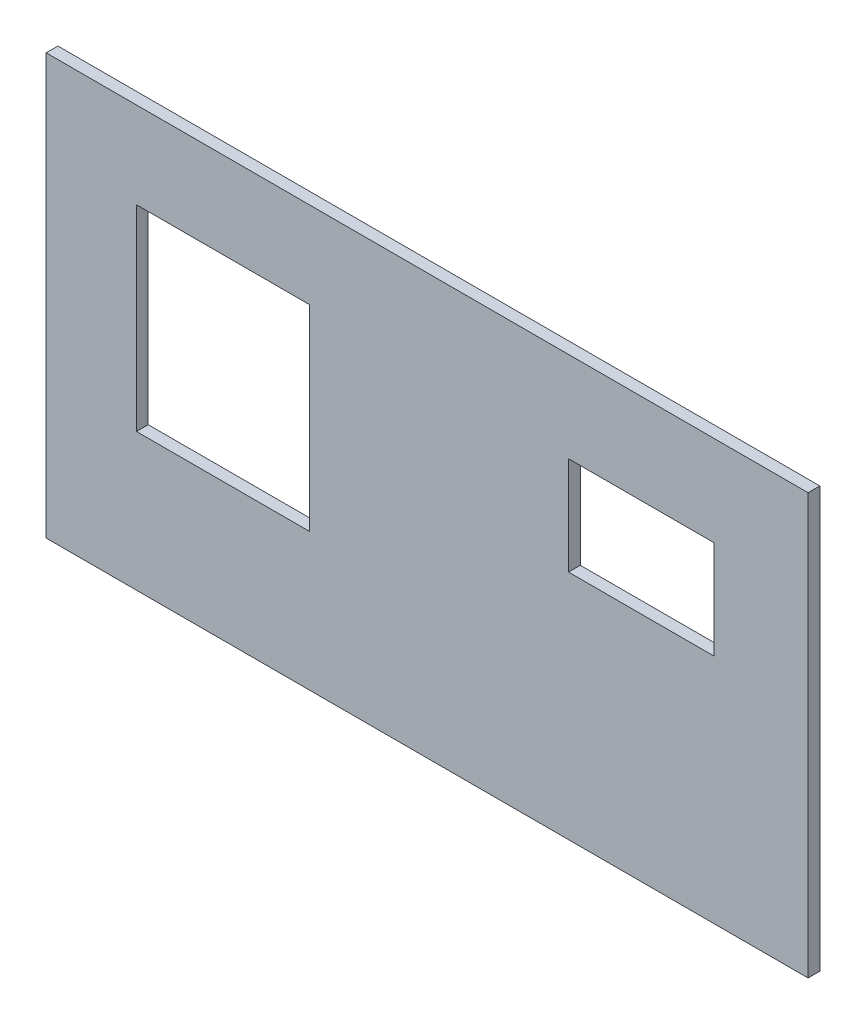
from build123d import *

# Parameters (mm, degrees)
ESQUISSE1_W             = 194
ESQUISSE1_H             = 107
EXTRUSION1_DEPTH        = 3
ESQUISSE2_W             = 44
ESQUISSE2_H             = 50
ESQUISSE2_W_2           = 37
ESQUISSE2_H_2           = 25
ENL_V_MAT_EXTRU_1_DEPTH = 3


with BuildPart() as part:
    # Esquisse1 → Extrusion1 (new body)
    with BuildSketch(Plane.XY):
        with Locations((97, 53.5)):
            Rectangle(ESQUISSE1_W, ESQUISSE1_H)
    extrude(amount=EXTRUSION1_DEPTH)

    # Esquisse2 → Enl_v. mat.-Extru.1 (cut)
    with BuildSketch(Plane.XY.offset(3)):
        with Locations((45, 60)):
            Rectangle(ESQUISSE2_W, ESQUISSE2_H)
        with Locations((151.5, 71.5)):
            Rectangle(ESQUISSE2_W_2, ESQUISSE2_H_2)
    extrude(amount=-ENL_V_MAT_EXTRU_1_DEPTH, mode=Mode.SUBTRACT)


solid = part.part
